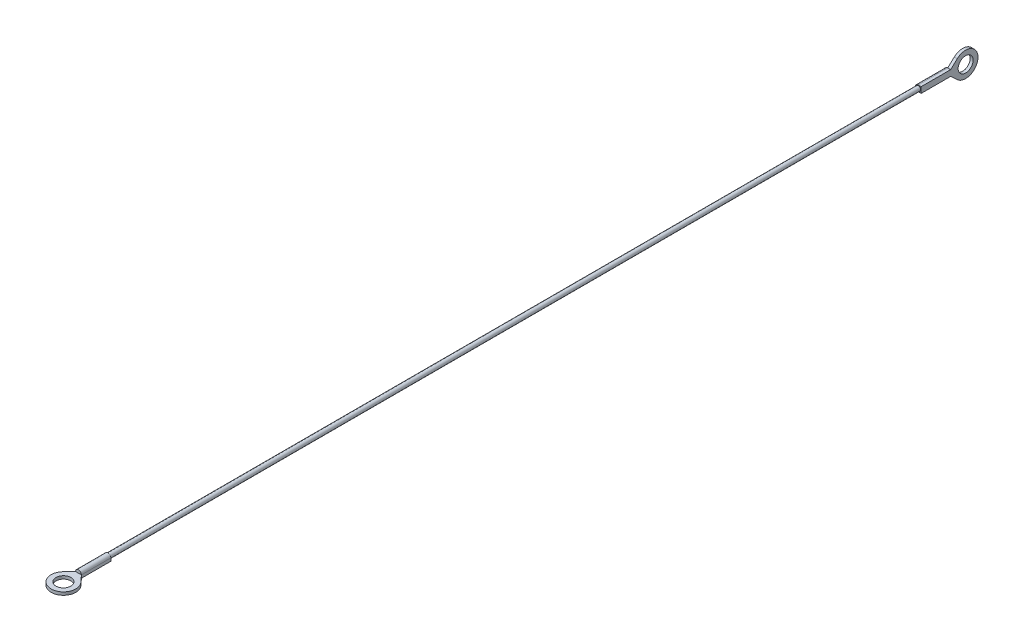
ISO-10303-21;
HEADER;
FILE_DESCRIPTION(('STEP AP214'),'2;1');
FILE_NAME('part.step','',(''),(''),'','','');
FILE_SCHEMA(('AUTOMOTIVE_DESIGN { 1 0 10303 214 1 1 1 1 }'));
ENDSEC;
DATA;
#1=APPLICATION_CONTEXT('core data for automotive mechanical design processes');
#2=APPLICATION_PROTOCOL_DEFINITION('international standard','automotive_design',2000,#1);
#3=PRODUCT_CONTEXT('',#1,'mechanical');
#4=PRODUCT('Part','Part','',(#3));
#5=PRODUCT_RELATED_PRODUCT_CATEGORY('part','',(#4));
#6=PRODUCT_DEFINITION_FORMATION('','',#4);
#7=PRODUCT_DEFINITION_CONTEXT('part definition',#1,'design');
#8=PRODUCT_DEFINITION('design','',#6,#7);
#9=PRODUCT_DEFINITION_SHAPE('','',#8);
#10=(LENGTH_UNIT() NAMED_UNIT(*) SI_UNIT(.MILLI.,.METRE.));
#11=(NAMED_UNIT(*) PLANE_ANGLE_UNIT() SI_UNIT($,.RADIAN.));
#12=(NAMED_UNIT(*) SI_UNIT($,.STERADIAN.) SOLID_ANGLE_UNIT());
#13=UNCERTAINTY_MEASURE_WITH_UNIT(LENGTH_MEASURE(1.E-05),#10,'distance_accuracy_value','');
#14=(GEOMETRIC_REPRESENTATION_CONTEXT(3) GLOBAL_UNCERTAINTY_ASSIGNED_CONTEXT((#13)) GLOBAL_UNIT_ASSIGNED_CONTEXT((#10,
#11,#12)) REPRESENTATION_CONTEXT('',''));
#15=CARTESIAN_POINT('',(0.,0.,0.));
#16=DIRECTION('',(0.,0.,1.));
#17=DIRECTION('',(1.,0.,0.));
#18=AXIS2_PLACEMENT_3D('',#15,#16,#17);
#19=CARTESIAN_POINT('',(0.,0.,-147.32));
#20=DIRECTION('',(0.,0.,-1.));
#21=DIRECTION('',(-1.,0.,0.));
#22=AXIS2_PLACEMENT_3D('',#19,#20,#21);
#23=PLANE('',#22);
#24=CARTESIAN_POINT('',(0.,-0.995,-147.32));
#25=CARTESIAN_POINT('',(-0.411702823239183,-0.995,-147.32));
#26=CARTESIAN_POINT('',(-0.703571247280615,-0.703571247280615,-147.32));
#27=CARTESIAN_POINT('',(-0.994688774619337,-0.412892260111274,-147.32));
#28=CARTESIAN_POINT('',(-0.995,0.,-147.32));
#29=CARTESIAN_POINT('',(-0.995310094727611,0.411392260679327,-147.32));
#30=CARTESIAN_POINT('',(-0.703571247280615,0.703571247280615,-147.32));
#31=CARTESIAN_POINT('',(-0.41258150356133,0.995,-147.32));
#32=CARTESIAN_POINT('',(0.,0.995,-147.32));
#33=B_SPLINE_CURVE_WITH_KNOTS('',2,(#24,#25,#26,#27,#28,#29,#30,#31,#32),.UNSPECIFIED.,.F.,.F.,
(3,2,2,2,3),(0.,0.25,0.5,0.75,1.),.UNSPECIFIED.);
#34=CARTESIAN_POINT('',(-0.00750000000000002,-0.995,-147.32));
#35=VERTEX_POINT('',#34);
#36=CARTESIAN_POINT('',(-0.00750000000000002,0.995,-147.32));
#37=VERTEX_POINT('',#36);
#38=EDGE_CURVE('E180',#35,#37,#33,.T.);
#39=ORIENTED_EDGE('',*,*,#38,.T.);
#40=DIRECTION('',(0.,-1.,0.));
#41=VECTOR('',#40,1.);
#42=CARTESIAN_POINT('',(-0.015,-0.995,-147.32));
#43=LINE('',#42,#41);
#44=EDGE_CURVE('E138',#37,#35,#43,.T.);
#45=ORIENTED_EDGE('',*,*,#44,.T.);
#46=EDGE_LOOP('',(#39,#45));
#47=FACE_BOUND('',#46,.T.);
#48=ADVANCED_FACE('F39',(#47),#23,.T.);
#49=CARTESIAN_POINT('',(0.,0.,147.32));
#50=DIRECTION('',(0.,0.,1.));
#51=DIRECTION('',(1.,0.,0.));
#52=AXIS2_PLACEMENT_3D('',#49,#50,#51);
#53=PLANE('',#52);
#54=CARTESIAN_POINT('',(0.995,0.,147.32));
#55=CARTESIAN_POINT('',(0.995,0.411702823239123,147.32));
#56=CARTESIAN_POINT('',(0.703571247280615,0.703571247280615,147.32));
#57=CARTESIAN_POINT('',(0.412892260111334,0.994688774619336,147.32));
#58=CARTESIAN_POINT('',(0.,0.995,147.32));
#59=CARTESIAN_POINT('',(-0.411392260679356,0.995310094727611,147.32));
#60=CARTESIAN_POINT('',(-0.703571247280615,0.703571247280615,147.32));
#61=CARTESIAN_POINT('',(-0.995,0.412581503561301,147.32));
#62=CARTESIAN_POINT('',(-0.995,0.,147.32));
#63=B_SPLINE_CURVE_WITH_KNOTS('',2,(#54,#55,#56,#57,#58,#59,#60,#61,#62),.UNSPECIFIED.,.F.,.F.,
(3,2,2,2,3),(0.,0.25,0.5,0.75,1.),.UNSPECIFIED.);
#64=CARTESIAN_POINT('',(0.995,0.00749999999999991,147.32));
#65=VERTEX_POINT('',#64);
#66=CARTESIAN_POINT('',(-0.995,0.00749999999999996,147.32));
#67=VERTEX_POINT('',#66);
#68=EDGE_CURVE('E273',#65,#67,#63,.T.);
#69=ORIENTED_EDGE('',*,*,#68,.T.);
#70=DIRECTION('',(1.,0.,0.));
#71=VECTOR('',#70,1.);
#72=CARTESIAN_POINT('',(-0.995,0.015,147.32));
#73=LINE('',#72,#71);
#74=EDGE_CURVE('E227',#67,#65,#73,.T.);
#75=ORIENTED_EDGE('',*,*,#74,.T.);
#76=EDGE_LOOP('',(#69,#75));
#77=FACE_BOUND('',#76,.T.);
#78=ADVANCED_FACE('F250',(#77),#53,.T.);
#79=CARTESIAN_POINT('',(0.,0.,137.32));
#80=DIRECTION('',(0.,0.,-1.));
#81=DIRECTION('',(-1.,0.,0.));
#82=AXIS2_PLACEMENT_3D('',#79,#80,#81);
#83=CYLINDRICAL_SURFACE('',#82,0.795);
#84=CARTESIAN_POINT('',(0.,0.,137.32));
#85=DIRECTION('',(0.,0.,1.));
#86=DIRECTION('',(1.,0.,0.));
#87=AXIS2_PLACEMENT_3D('',#84,#85,#86);
#88=CIRCLE('',#87,0.795);
#89=CARTESIAN_POINT('',(0.795,0.,137.32));
#90=VERTEX_POINT('',#89);
#91=EDGE_CURVE('E11',#90,#90,#88,.T.);
#92=ORIENTED_EDGE('',*,*,#91,.F.);
#93=EDGE_LOOP('',(#92));
#94=FACE_BOUND('',#93,.T.);
#95=CARTESIAN_POINT('',(0.,0.,-137.32));
#96=DIRECTION('',(0.,0.,1.));
#97=DIRECTION('',(1.,0.,0.));
#98=AXIS2_PLACEMENT_3D('',#95,#96,#97);
#99=CIRCLE('',#98,0.795);
#100=CARTESIAN_POINT('',(0.795,0.,-137.32));
#101=VERTEX_POINT('',#100);
#102=EDGE_CURVE('E196',#101,#101,#99,.T.);
#103=ORIENTED_EDGE('',*,*,#102,.T.);
#104=EDGE_LOOP('',(#103));
#105=FACE_BOUND('',#104,.T.);
#106=ADVANCED_FACE('F41',(#94,#105),#83,.T.);
#107=CARTESIAN_POINT('',(0.,0.,147.32));
#108=DIRECTION('',(0.,0.,-1.));
#109=DIRECTION('',(-1.,0.,0.));
#110=AXIS2_PLACEMENT_3D('',#107,#108,#109);
#111=CYLINDRICAL_SURFACE('',#110,0.995);
#112=CARTESIAN_POINT('',(0.,0.,137.32));
#113=DIRECTION('',(0.,0.,1.));
#114=DIRECTION('',(1.,0.,0.));
#115=AXIS2_PLACEMENT_3D('',#112,#113,#114);
#116=CIRCLE('',#115,0.995);
#117=CARTESIAN_POINT('',(0.995,0.,137.32));
#118=VERTEX_POINT('',#117);
#119=CARTESIAN_POINT('',(-0.995,0.,137.32));
#120=VERTEX_POINT('',#119);
#121=EDGE_CURVE('E212',#118,#120,#116,.T.);
#122=ORIENTED_EDGE('',*,*,#121,.T.);
#123=DIRECTION('',(0.,0.,-1.));
#124=VECTOR('',#123,1.);
#125=CARTESIAN_POINT('',(-0.995,0.,147.32));
#126=LINE('',#125,#124);
#127=EDGE_CURVE('E50',#67,#120,#126,.T.);
#128=ORIENTED_EDGE('',*,*,#127,.F.);
#129=ORIENTED_EDGE('',*,*,#68,.F.);
#130=DIRECTION('',(0.,0.,-1.));
#131=VECTOR('',#130,1.);
#132=CARTESIAN_POINT('',(0.995,0.,147.32));
#133=LINE('',#132,#131);
#134=EDGE_CURVE('E405',#65,#118,#133,.T.);
#135=ORIENTED_EDGE('',*,*,#134,.T.);
#136=EDGE_LOOP('',(#122,#128,#129,#135));
#137=FACE_BOUND('',#136,.T.);
#138=ADVANCED_FACE('F279',(#137),#111,.T.);
#139=CARTESIAN_POINT('',(-0.995,0.,147.32));
#140=DIRECTION('',(1.,0.,0.));
#141=DIRECTION('',(0.,1.,0.));
#142=AXIS2_PLACEMENT_3D('',#139,#140,#141);
#143=PLANE('',#142);
#144=DIRECTION('',(0.,-1.,0.));
#145=VECTOR('',#144,1.);
#146=CARTESIAN_POINT('',(-0.995,0.,137.32));
#147=LINE('',#146,#145);
#148=CARTESIAN_POINT('',(-0.995,-0.995,137.32));
#149=VERTEX_POINT('',#148);
#150=EDGE_CURVE('E401',#120,#149,#147,.T.);
#151=ORIENTED_EDGE('',*,*,#150,.T.);
#152=DIRECTION('',(0.,0.,-1.));
#153=VECTOR('',#152,1.);
#154=CARTESIAN_POINT('',(-0.995,-0.995,147.32));
#155=LINE('',#154,#153);
#156=CARTESIAN_POINT('',(-0.995,-0.995,147.32));
#157=VERTEX_POINT('',#156);
#158=EDGE_CURVE('E300',#157,#149,#155,.T.);
#159=ORIENTED_EDGE('',*,*,#158,.F.);
#160=CARTESIAN_POINT('',(-0.994999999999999,0.015,147.32));
#161=DIRECTION('',(0.,-1.,0.));
#162=VECTOR('',#161,1.);
#163=LINE('',#160,#162);
#164=EDGE_CURVE('E221',#67,#157,#163,.T.);
#165=ORIENTED_EDGE('',*,*,#164,.F.);
#166=ORIENTED_EDGE('',*,*,#127,.T.);
#167=EDGE_LOOP('',(#151,#159,#165,#166));
#168=FACE_BOUND('',#167,.T.);
#169=ADVANCED_FACE('F288',(#168),#143,.F.);
#170=CARTESIAN_POINT('',(0.,-0.995,147.32));
#171=DIRECTION('',(0.,1.,0.));
#172=DIRECTION('',(0.,0.,1.));
#173=AXIS2_PLACEMENT_3D('',#170,#171,#172);
#174=PLANE('',#173);
#175=DIRECTION('',(1.,0.,0.));
#176=VECTOR('',#175,1.);
#177=CARTESIAN_POINT('',(0.,-0.995,137.32));
#178=LINE('',#177,#176);
#179=CARTESIAN_POINT('',(0.995,-0.995,137.32));
#180=VERTEX_POINT('',#179);
#181=EDGE_CURVE('E431',#149,#180,#178,.T.);
#182=ORIENTED_EDGE('',*,*,#181,.T.);
#183=DIRECTION('',(0.,0.,-1.));
#184=VECTOR('',#183,1.);
#185=CARTESIAN_POINT('',(0.995,-0.995,147.32));
#186=LINE('',#185,#184);
#187=CARTESIAN_POINT('',(0.995,-0.995,147.32));
#188=VERTEX_POINT('',#187);
#189=EDGE_CURVE('E309',#188,#180,#186,.T.);
#190=ORIENTED_EDGE('',*,*,#189,.F.);
#191=DIRECTION('',(0.68145689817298,0.,0.731858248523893));
#192=VECTOR('',#191,1.);
#193=CARTESIAN_POINT('',(0.995,-0.995,147.32));
#194=LINE('',#193,#192);
#195=CARTESIAN_POINT('',(3.06648606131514,-0.995,149.544695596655));
#196=VERTEX_POINT('',#195);
#197=EDGE_CURVE('E191',#188,#196,#194,.T.);
#198=ORIENTED_EDGE('',*,*,#197,.T.);
#199=CARTESIAN_POINT('',(0.,-0.995,152.4));
#200=DIRECTION('',(0.,-1.,0.));
#201=DIRECTION('',(0.,0.,-1.));
#202=AXIS2_PLACEMENT_3D('',#199,#200,#201);
#203=CIRCLE('',#202,4.19000000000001);
#204=CARTESIAN_POINT('',(-3.06648606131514,-0.995,149.544695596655));
#205=VERTEX_POINT('',#204);
#206=EDGE_CURVE('E205',#196,#205,#203,.T.);
#207=ORIENTED_EDGE('',*,*,#206,.T.);
#208=DIRECTION('',(0.68145689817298,0.,-0.731858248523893));
#209=VECTOR('',#208,1.);
#210=CARTESIAN_POINT('',(-3.06648606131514,-0.995,149.544695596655));
#211=LINE('',#210,#209);
#212=EDGE_CURVE('E209',#205,#157,#211,.T.);
#213=ORIENTED_EDGE('',*,*,#212,.T.);
#214=ORIENTED_EDGE('',*,*,#158,.T.);
#215=EDGE_LOOP('',(#182,#190,#198,#207,#213,#214));
#216=FACE_BOUND('',#215,.T.);
#217=CARTESIAN_POINT('',(0.,-0.995,152.4));
#218=DIRECTION('',(0.,-1.,0.));
#219=DIRECTION('',(0.,0.,-1.));
#220=AXIS2_PLACEMENT_3D('',#217,#218,#219);
#221=CIRCLE('',#220,2.54);
#222=CARTESIAN_POINT('',(0.,-0.995,149.86));
#223=VERTEX_POINT('',#222);
#224=EDGE_CURVE('E192',#223,#223,#221,.T.);
#225=ORIENTED_EDGE('',*,*,#224,.F.);
#226=EDGE_LOOP('',(#225));
#227=FACE_BOUND('',#226,.T.);
#228=ADVANCED_FACE('F292',(#216,#227),#174,.F.);
#229=CARTESIAN_POINT('',(0.995,-0.995,147.32));
#230=DIRECTION('',(-1.,0.,0.));
#231=DIRECTION('',(0.,-1.,0.));
#232=AXIS2_PLACEMENT_3D('',#229,#230,#231);
#233=PLANE('',#232);
#234=DIRECTION('',(0.,1.,0.));
#235=VECTOR('',#234,1.);
#236=CARTESIAN_POINT('',(0.995,-0.995,137.32));
#237=LINE('',#236,#235);
#238=EDGE_CURVE('E434',#180,#118,#237,.T.);
#239=ORIENTED_EDGE('',*,*,#238,.T.);
#240=ORIENTED_EDGE('',*,*,#134,.F.);
#241=DIRECTION('',(0.,1.,0.));
#242=VECTOR('',#241,1.);
#243=CARTESIAN_POINT('',(0.995,-0.995,147.32));
#244=LINE('',#243,#242);
#245=EDGE_CURVE('E277',#188,#65,#244,.T.);
#246=ORIENTED_EDGE('',*,*,#245,.F.);
#247=ORIENTED_EDGE('',*,*,#189,.T.);
#248=EDGE_LOOP('',(#239,#240,#246,#247));
#249=FACE_BOUND('',#248,.T.);
#250=ADVANCED_FACE('F456',(#249),#233,.F.);
#251=CARTESIAN_POINT('',(0.,0.,137.32));
#252=DIRECTION('',(0.,0.,1.));
#253=DIRECTION('',(1.,0.,0.));
#254=AXIS2_PLACEMENT_3D('',#251,#252,#253);
#255=PLANE('',#254);
#256=ORIENTED_EDGE('',*,*,#91,.T.);
#257=EDGE_LOOP('',(#256));
#258=FACE_BOUND('',#257,.T.);
#259=ORIENTED_EDGE('',*,*,#121,.F.);
#260=ORIENTED_EDGE('',*,*,#238,.F.);
#261=ORIENTED_EDGE('',*,*,#181,.F.);
#262=ORIENTED_EDGE('',*,*,#150,.F.);
#263=EDGE_LOOP('',(#259,#260,#261,#262));
#264=FACE_BOUND('',#263,.T.);
#265=ADVANCED_FACE('F240',(#258,#264),#255,.F.);
#266=CARTESIAN_POINT('',(-3.06648606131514,0.015,149.544695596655));
#267=DIRECTION('',(-0.731858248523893,0.,-0.68145689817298));
#268=DIRECTION('',(-0.68145689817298,0.,0.731858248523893));
#269=AXIS2_PLACEMENT_3D('',#266,#267,#268);
#270=PLANE('',#269);
#271=ORIENTED_EDGE('',*,*,#212,.F.);
#272=DIRECTION('',(0.,-1.,0.));
#273=VECTOR('',#272,1.);
#274=CARTESIAN_POINT('',(-3.06648606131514,0.015,149.544695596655));
#275=LINE('',#274,#273);
#276=CARTESIAN_POINT('',(-3.06648606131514,0.015,149.544695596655));
#277=VERTEX_POINT('',#276);
#278=EDGE_CURVE('E210',#277,#205,#275,.T.);
#279=ORIENTED_EDGE('',*,*,#278,.F.);
#280=DIRECTION('',(0.68145689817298,0.,-0.731858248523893));
#281=VECTOR('',#280,1.);
#282=CARTESIAN_POINT('',(-3.06648606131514,0.015,149.544695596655));
#283=LINE('',#282,#281);
#284=EDGE_CURVE('E201',#277,#67,#283,.T.);
#285=ORIENTED_EDGE('',*,*,#284,.T.);
#286=ORIENTED_EDGE('',*,*,#164,.T.);
#287=EDGE_LOOP('',(#271,#279,#285,#286));
#288=FACE_BOUND('',#287,.T.);
#289=ADVANCED_FACE('F229',(#288),#270,.T.);
#290=CARTESIAN_POINT('',(0.,0.015,152.4));
#291=DIRECTION('',(0.,-1.,0.));
#292=DIRECTION('',(0.,0.,-1.));
#293=AXIS2_PLACEMENT_3D('',#290,#291,#292);
#294=CYLINDRICAL_SURFACE('',#293,4.19000000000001);
#295=ORIENTED_EDGE('',*,*,#206,.F.);
#296=DIRECTION('',(0.,-1.,0.));
#297=VECTOR('',#296,1.);
#298=CARTESIAN_POINT('',(3.06648606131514,0.015,149.544695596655));
#299=LINE('',#298,#297);
#300=CARTESIAN_POINT('',(3.06648606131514,0.015,149.544695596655));
#301=VERTEX_POINT('',#300);
#302=EDGE_CURVE('E213',#301,#196,#299,.T.);
#303=ORIENTED_EDGE('',*,*,#302,.F.);
#304=CARTESIAN_POINT('',(0.,0.015,152.4));
#305=DIRECTION('',(0.,-1.,0.));
#306=DIRECTION('',(0.,0.,-1.));
#307=AXIS2_PLACEMENT_3D('',#304,#305,#306);
#308=CIRCLE('',#307,4.19000000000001);
#309=EDGE_CURVE('E197',#301,#277,#308,.T.);
#310=ORIENTED_EDGE('',*,*,#309,.T.);
#311=ORIENTED_EDGE('',*,*,#278,.T.);
#312=EDGE_LOOP('',(#295,#303,#310,#311));
#313=FACE_BOUND('',#312,.T.);
#314=ADVANCED_FACE('F239',(#313),#294,.T.);
#315=CARTESIAN_POINT('',(0.995,0.015,147.32));
#316=DIRECTION('',(0.731858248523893,0.,-0.68145689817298));
#317=DIRECTION('',(-0.68145689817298,0.,-0.731858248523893));
#318=AXIS2_PLACEMENT_3D('',#315,#316,#317);
#319=PLANE('',#318);
#320=ORIENTED_EDGE('',*,*,#197,.F.);
#321=ORIENTED_EDGE('',*,*,#245,.T.);
#322=DIRECTION('',(0.68145689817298,0.,0.731858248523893));
#323=VECTOR('',#322,1.);
#324=CARTESIAN_POINT('',(0.995,0.015,147.32));
#325=LINE('',#324,#323);
#326=EDGE_CURVE('E58',#65,#301,#325,.T.);
#327=ORIENTED_EDGE('',*,*,#326,.T.);
#328=ORIENTED_EDGE('',*,*,#302,.T.);
#329=EDGE_LOOP('',(#320,#321,#327,#328));
#330=FACE_BOUND('',#329,.T.);
#331=ADVANCED_FACE('F245',(#330),#319,.T.);
#332=CARTESIAN_POINT('',(0.,0.015,152.4));
#333=DIRECTION('',(0.,-1.,0.));
#334=DIRECTION('',(0.,0.,-1.));
#335=AXIS2_PLACEMENT_3D('',#332,#333,#334);
#336=PLANE('',#335);
#337=CARTESIAN_POINT('',(0.,0.015,152.4));
#338=DIRECTION('',(0.,-1.,0.));
#339=DIRECTION('',(0.,0.,-1.));
#340=AXIS2_PLACEMENT_3D('',#337,#338,#339);
#341=CIRCLE('',#340,2.54);
#342=CARTESIAN_POINT('',(0.,0.015,149.86));
#343=VERTEX_POINT('',#342);
#344=EDGE_CURVE('E187',#343,#343,#341,.T.);
#345=ORIENTED_EDGE('',*,*,#344,.T.);
#346=EDGE_LOOP('',(#345));
#347=FACE_BOUND('',#346,.T.);
#348=ORIENTED_EDGE('',*,*,#74,.F.);
#349=ORIENTED_EDGE('',*,*,#284,.F.);
#350=ORIENTED_EDGE('',*,*,#309,.F.);
#351=ORIENTED_EDGE('',*,*,#326,.F.);
#352=EDGE_LOOP('',(#348,#349,#350,#351));
#353=FACE_BOUND('',#352,.T.);
#354=ADVANCED_FACE('F241',(#347,#353),#336,.F.);
#355=CARTESIAN_POINT('',(0.,0.015,152.4));
#356=DIRECTION('',(0.,-1.,0.));
#357=DIRECTION('',(0.,0.,-1.));
#358=AXIS2_PLACEMENT_3D('',#355,#356,#357);
#359=CYLINDRICAL_SURFACE('',#358,2.54);
#360=ORIENTED_EDGE('',*,*,#344,.F.);
#361=EDGE_LOOP('',(#360));
#362=FACE_BOUND('',#361,.T.);
#363=ORIENTED_EDGE('',*,*,#224,.T.);
#364=EDGE_LOOP('',(#363));
#365=FACE_BOUND('',#364,.T.);
#366=ADVANCED_FACE('F499',(#362,#365),#359,.F.);
#367=CARTESIAN_POINT('',(0.,0.,-147.32));
#368=DIRECTION('',(0.,0.,1.));
#369=DIRECTION('',(1.,0.,0.));
#370=AXIS2_PLACEMENT_3D('',#367,#368,#369);
#371=CYLINDRICAL_SURFACE('',#370,0.995);
#372=CARTESIAN_POINT('',(0.,0.,-137.32));
#373=DIRECTION('',(0.,0.,-1.));
#374=DIRECTION('',(-1.,0.,0.));
#375=AXIS2_PLACEMENT_3D('',#372,#373,#374);
#376=CIRCLE('',#375,0.995);
#377=CARTESIAN_POINT('',(0.,-0.995,-137.32));
#378=VERTEX_POINT('',#377);
#379=CARTESIAN_POINT('',(0.,0.995,-137.32));
#380=VERTEX_POINT('',#379);
#381=EDGE_CURVE('E167',#378,#380,#376,.T.);
#382=ORIENTED_EDGE('',*,*,#381,.T.);
#383=DIRECTION('',(0.,0.,1.));
#384=VECTOR('',#383,1.);
#385=CARTESIAN_POINT('',(0.,0.995,-147.32));
#386=LINE('',#385,#384);
#387=EDGE_CURVE('E364',#37,#380,#386,.T.);
#388=ORIENTED_EDGE('',*,*,#387,.F.);
#389=ORIENTED_EDGE('',*,*,#38,.F.);
#390=DIRECTION('',(0.,0.,1.));
#391=VECTOR('',#390,1.);
#392=CARTESIAN_POINT('',(0.,-0.995,-147.32));
#393=LINE('',#392,#391);
#394=EDGE_CURVE('E186',#35,#378,#393,.T.);
#395=ORIENTED_EDGE('',*,*,#394,.T.);
#396=EDGE_LOOP('',(#382,#388,#389,#395));
#397=FACE_BOUND('',#396,.T.);
#398=ADVANCED_FACE('F348',(#397),#371,.T.);
#399=CARTESIAN_POINT('',(0.,0.995,-147.32));
#400=DIRECTION('',(0.,-1.,0.));
#401=DIRECTION('',(0.,0.,-1.));
#402=AXIS2_PLACEMENT_3D('',#399,#400,#401);
#403=PLANE('',#402);
#404=DIRECTION('',(1.,0.,0.));
#405=VECTOR('',#404,1.);
#406=CARTESIAN_POINT('',(0.,0.995,-137.32));
#407=LINE('',#406,#405);
#408=CARTESIAN_POINT('',(0.995,0.995,-137.32));
#409=VERTEX_POINT('',#408);
#410=EDGE_CURVE('E171',#380,#409,#407,.T.);
#411=ORIENTED_EDGE('',*,*,#410,.T.);
#412=DIRECTION('',(0.,0.,1.));
#413=VECTOR('',#412,1.);
#414=CARTESIAN_POINT('',(0.995,0.995,-147.32));
#415=LINE('',#414,#413);
#416=CARTESIAN_POINT('',(0.995,0.995,-147.32));
#417=VERTEX_POINT('',#416);
#418=EDGE_CURVE('E185',#417,#409,#415,.T.);
#419=ORIENTED_EDGE('',*,*,#418,.F.);
#420=CARTESIAN_POINT('',(-0.015,0.995,-147.32));
#421=DIRECTION('',(1.,0.,0.));
#422=VECTOR('',#421,1.);
#423=LINE('',#420,#422);
#424=EDGE_CURVE('E384',#37,#417,#423,.T.);
#425=ORIENTED_EDGE('',*,*,#424,.F.);
#426=ORIENTED_EDGE('',*,*,#387,.T.);
#427=EDGE_LOOP('',(#411,#419,#425,#426));
#428=FACE_BOUND('',#427,.T.);
#429=ADVANCED_FACE('F343',(#428),#403,.F.);
#430=CARTESIAN_POINT('',(0.995,0.,-147.32));
#431=DIRECTION('',(-1.,0.,0.));
#432=DIRECTION('',(0.,-1.,0.));
#433=AXIS2_PLACEMENT_3D('',#430,#431,#432);
#434=PLANE('',#433);
#435=DIRECTION('',(0.,-1.,0.));
#436=VECTOR('',#435,1.);
#437=CARTESIAN_POINT('',(0.995,0.,-137.32));
#438=LINE('',#437,#436);
#439=CARTESIAN_POINT('',(0.995,-0.995,-137.32));
#440=VERTEX_POINT('',#439);
#441=EDGE_CURVE('E175',#409,#440,#438,.T.);
#442=ORIENTED_EDGE('',*,*,#441,.T.);
#443=DIRECTION('',(0.,0.,1.));
#444=VECTOR('',#443,1.);
#445=CARTESIAN_POINT('',(0.995,-0.995,-147.32));
#446=LINE('',#445,#444);
#447=CARTESIAN_POINT('',(0.995,-0.995,-147.32));
#448=VERTEX_POINT('',#447);
#449=EDGE_CURVE('E181',#448,#440,#446,.T.);
#450=ORIENTED_EDGE('',*,*,#449,.F.);
#451=DIRECTION('',(0.,-0.681456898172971,-0.731858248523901));
#452=VECTOR('',#451,1.);
#453=CARTESIAN_POINT('',(0.995,-3.06648606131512,-149.544695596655));
#454=LINE('',#453,#452);
#455=CARTESIAN_POINT('',(0.995,-3.06648606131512,-149.544695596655));
#456=VERTEX_POINT('',#455);
#457=EDGE_CURVE('E407',#448,#456,#454,.T.);
#458=ORIENTED_EDGE('',*,*,#457,.T.);
#459=CARTESIAN_POINT('',(0.995,0.,-152.4));
#460=DIRECTION('',(1.,0.,0.));
#461=DIRECTION('',(0.,0.,1.));
#462=AXIS2_PLACEMENT_3D('',#459,#460,#461);
#463=CIRCLE('',#462,4.18999999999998);
#464=CARTESIAN_POINT('',(0.995,3.06648606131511,-149.544695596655));
#465=VERTEX_POINT('',#464);
#466=EDGE_CURVE('E132',#456,#465,#463,.T.);
#467=ORIENTED_EDGE('',*,*,#466,.T.);
#468=DIRECTION('',(0.,-0.681456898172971,0.731858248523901));
#469=VECTOR('',#468,1.);
#470=CARTESIAN_POINT('',(0.995,0.995,-147.32));
#471=LINE('',#470,#469);
#472=EDGE_CURVE('E155',#465,#417,#471,.T.);
#473=ORIENTED_EDGE('',*,*,#472,.T.);
#474=ORIENTED_EDGE('',*,*,#418,.T.);
#475=EDGE_LOOP('',(#442,#450,#458,#467,#473,#474));
#476=FACE_BOUND('',#475,.T.);
#477=CARTESIAN_POINT('',(0.995,0.,-152.4));
#478=DIRECTION('',(1.,0.,0.));
#479=DIRECTION('',(0.,0.,-1.));
#480=AXIS2_PLACEMENT_3D('',#477,#478,#479);
#481=CIRCLE('',#480,2.53999999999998);
#482=CARTESIAN_POINT('',(0.995,0.,-154.94));
#483=VERTEX_POINT('',#482);
#484=EDGE_CURVE('E682',#483,#483,#481,.T.);
#485=ORIENTED_EDGE('',*,*,#484,.F.);
#486=EDGE_LOOP('',(#485));
#487=FACE_BOUND('',#486,.T.);
#488=ADVANCED_FACE('F339',(#476,#487),#434,.F.);
#489=CARTESIAN_POINT('',(0.995,-0.995,-147.32));
#490=DIRECTION('',(0.,1.,0.));
#491=DIRECTION('',(0.,0.,1.));
#492=AXIS2_PLACEMENT_3D('',#489,#490,#491);
#493=PLANE('',#492);
#494=DIRECTION('',(-1.,0.,0.));
#495=VECTOR('',#494,1.);
#496=CARTESIAN_POINT('',(0.995,-0.995,-137.32));
#497=LINE('',#496,#495);
#498=EDGE_CURVE('E178',#440,#378,#497,.T.);
#499=ORIENTED_EDGE('',*,*,#498,.T.);
#500=ORIENTED_EDGE('',*,*,#394,.F.);
#501=DIRECTION('',(-1.,0.,0.));
#502=VECTOR('',#501,1.);
#503=CARTESIAN_POINT('',(0.995,-0.995,-147.32));
#504=LINE('',#503,#502);
#505=EDGE_CURVE('E152',#448,#35,#504,.T.);
#506=ORIENTED_EDGE('',*,*,#505,.F.);
#507=ORIENTED_EDGE('',*,*,#449,.T.);
#508=EDGE_LOOP('',(#499,#500,#506,#507));
#509=FACE_BOUND('',#508,.T.);
#510=ADVANCED_FACE('F335',(#509),#493,.F.);
#511=CARTESIAN_POINT('',(0.,0.,-137.32));
#512=DIRECTION('',(0.,0.,-1.));
#513=DIRECTION('',(-1.,0.,0.));
#514=AXIS2_PLACEMENT_3D('',#511,#512,#513);
#515=PLANE('',#514);
#516=ORIENTED_EDGE('',*,*,#102,.F.);
#517=EDGE_LOOP('',(#516));
#518=FACE_BOUND('',#517,.T.);
#519=ORIENTED_EDGE('',*,*,#381,.F.);
#520=ORIENTED_EDGE('',*,*,#498,.F.);
#521=ORIENTED_EDGE('',*,*,#441,.F.);
#522=ORIENTED_EDGE('',*,*,#410,.F.);
#523=EDGE_LOOP('',(#519,#520,#521,#522));
#524=FACE_BOUND('',#523,.T.);
#525=ADVANCED_FACE('F332',(#518,#524),#515,.F.);
#526=CARTESIAN_POINT('',(-0.015,-3.06648606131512,-149.544695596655));
#527=DIRECTION('',(0.,-0.731858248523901,0.681456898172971));
#528=DIRECTION('',(0.,-0.681456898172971,-0.731858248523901));
#529=AXIS2_PLACEMENT_3D('',#526,#527,#528);
#530=PLANE('',#529);
#531=ORIENTED_EDGE('',*,*,#457,.F.);
#532=ORIENTED_EDGE('',*,*,#505,.T.);
#533=DIRECTION('',(0.,-0.681456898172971,-0.731858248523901));
#534=VECTOR('',#533,1.);
#535=CARTESIAN_POINT('',(-0.015,-3.06648606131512,-149.544695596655));
#536=LINE('',#535,#534);
#537=CARTESIAN_POINT('',(-0.015,-3.06648606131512,-149.544695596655));
#538=VERTEX_POINT('',#537);
#539=EDGE_CURVE('E145',#35,#538,#536,.T.);
#540=ORIENTED_EDGE('',*,*,#539,.T.);
#541=DIRECTION('',(1.,0.,0.));
#542=VECTOR('',#541,1.);
#543=CARTESIAN_POINT('',(-0.015,-3.06648606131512,-149.544695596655));
#544=LINE('',#543,#542);
#545=EDGE_CURVE('E127',#538,#456,#544,.T.);
#546=ORIENTED_EDGE('',*,*,#545,.T.);
#547=EDGE_LOOP('',(#531,#532,#540,#546));
#548=FACE_BOUND('',#547,.T.);
#549=ADVANCED_FACE('F150',(#548),#530,.T.);
#550=CARTESIAN_POINT('',(-0.015,0.995,-147.32));
#551=DIRECTION('',(0.,0.731858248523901,0.681456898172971));
#552=DIRECTION('',(0.,-0.681456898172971,0.731858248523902));
#553=AXIS2_PLACEMENT_3D('',#550,#551,#552);
#554=PLANE('',#553);
#555=ORIENTED_EDGE('',*,*,#472,.F.);
#556=DIRECTION('',(1.,0.,0.));
#557=VECTOR('',#556,1.);
#558=CARTESIAN_POINT('',(-0.015,3.06648606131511,-149.544695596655));
#559=LINE('',#558,#557);
#560=CARTESIAN_POINT('',(-0.015,3.06648606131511,-149.544695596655));
#561=VERTEX_POINT('',#560);
#562=EDGE_CURVE('E137',#561,#465,#559,.T.);
#563=ORIENTED_EDGE('',*,*,#562,.F.);
#564=DIRECTION('',(0.,-0.681456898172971,0.731858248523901));
#565=VECTOR('',#564,1.);
#566=CARTESIAN_POINT('',(-0.015,0.995,-147.32));
#567=LINE('',#566,#565);
#568=EDGE_CURVE('E147',#561,#37,#567,.T.);
#569=ORIENTED_EDGE('',*,*,#568,.T.);
#570=ORIENTED_EDGE('',*,*,#424,.T.);
#571=EDGE_LOOP('',(#555,#563,#569,#570));
#572=FACE_BOUND('',#571,.T.);
#573=ADVANCED_FACE('F529',(#572),#554,.T.);
#574=CARTESIAN_POINT('',(-0.015,0.,-152.4));
#575=DIRECTION('',(1.,0.,0.));
#576=DIRECTION('',(0.,0.,-1.));
#577=AXIS2_PLACEMENT_3D('',#574,#575,#576);
#578=CYLINDRICAL_SURFACE('',#577,4.18999999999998);
#579=ORIENTED_EDGE('',*,*,#466,.F.);
#580=ORIENTED_EDGE('',*,*,#545,.F.);
#581=CARTESIAN_POINT('',(-0.015,0.,-152.4));
#582=DIRECTION('',(1.,0.,0.));
#583=DIRECTION('',(0.,0.,1.));
#584=AXIS2_PLACEMENT_3D('',#581,#582,#583);
#585=CIRCLE('',#584,4.18999999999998);
#586=EDGE_CURVE('E130',#538,#561,#585,.T.);
#587=ORIENTED_EDGE('',*,*,#586,.T.);
#588=ORIENTED_EDGE('',*,*,#562,.T.);
#589=EDGE_LOOP('',(#579,#580,#587,#588));
#590=FACE_BOUND('',#589,.T.);
#591=ADVANCED_FACE('F129',(#590),#578,.T.);
#592=CARTESIAN_POINT('',(-0.015,0.,-152.4));
#593=DIRECTION('',(-1.,0.,0.));
#594=DIRECTION('',(0.,0.,1.));
#595=AXIS2_PLACEMENT_3D('',#592,#593,#594);
#596=PLANE('',#595);
#597=CARTESIAN_POINT('',(-0.015,0.,-152.4));
#598=DIRECTION('',(1.,0.,0.));
#599=DIRECTION('',(0.,0.,-1.));
#600=AXIS2_PLACEMENT_3D('',#597,#598,#599);
#601=CIRCLE('',#600,2.53999999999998);
#602=CARTESIAN_POINT('',(-0.015,0.,-154.94));
#603=VERTEX_POINT('',#602);
#604=EDGE_CURVE('E409',#603,#603,#601,.T.);
#605=ORIENTED_EDGE('',*,*,#604,.T.);
#606=EDGE_LOOP('',(#605));
#607=FACE_BOUND('',#606,.T.);
#608=ORIENTED_EDGE('',*,*,#539,.F.);
#609=ORIENTED_EDGE('',*,*,#44,.F.);
#610=ORIENTED_EDGE('',*,*,#568,.F.);
#611=ORIENTED_EDGE('',*,*,#586,.F.);
#612=EDGE_LOOP('',(#608,#609,#610,#611));
#613=FACE_BOUND('',#612,.T.);
#614=ADVANCED_FACE('F143',(#607,#613),#596,.T.);
#615=CARTESIAN_POINT('',(-0.015,0.,-152.4));
#616=DIRECTION('',(1.,0.,0.));
#617=DIRECTION('',(0.,0.,-1.));
#618=AXIS2_PLACEMENT_3D('',#615,#616,#617);
#619=CYLINDRICAL_SURFACE('',#618,2.53999999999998);
#620=ORIENTED_EDGE('',*,*,#604,.F.);
#621=EDGE_LOOP('',(#620));
#622=FACE_BOUND('',#621,.T.);
#623=ORIENTED_EDGE('',*,*,#484,.T.);
#624=EDGE_LOOP('',(#623));
#625=FACE_BOUND('',#624,.T.);
#626=ADVANCED_FACE('F552',(#622,#625),#619,.F.);
#627=CLOSED_SHELL('',(#48,#78,#106,#138,#169,#228,#250,#265,#289,#314,#331,#354,#366,#398,#429,
#488,#510,#525,#549,#573,#591,#614,#626));
#628=MANIFOLD_SOLID_BREP('B2',#627);
#629=ADVANCED_BREP_SHAPE_REPRESENTATION('',(#18,#628),#14);
#630=SHAPE_DEFINITION_REPRESENTATION(#9,#629);
ENDSEC;
END-ISO-10303-21;
